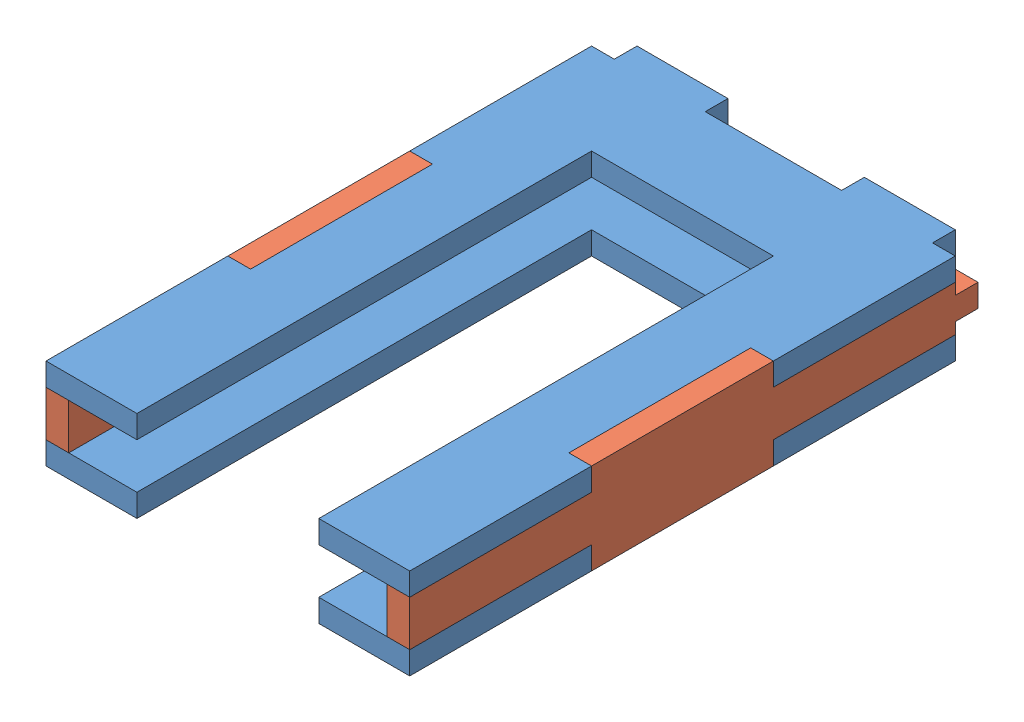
SolidWorks assembly Assem1.sldasm, configuration Default (file format 4700). Lengths in mm.
Overall size (50.8 12.7 79.38).
4 component instances, 2 part files, 9 mates.
Components (placement in the parent):
- fireguidefront-1: fireguidefront.SLDPRT [Default] at (0.7646 17.162 -13.1416) size (50.8 3.17 79.38)
- fireguideside-1: fireguideside.SLDPRT [Default] at (-21.4604 13.987 -13.1416) x (0 1 0) z (0 0 1) size (12.7 3.17 79.38)
- fireguidefront-2: fireguidefront.SLDPRT [Default] at (0.7646 7.637 -13.1416) size (50.8 3.17 79.38)
- fireguideside-2: fireguideside.SLDPRT [Default] at (22.9896 13.987 -13.1416) x (0 -1 0) z (0 0 1) size (12.7 3.17 79.38)
Mates (geometry in assembly coordinates):
- Coincident2: coincident aligned: plane of fireguidefront-1 through (-24.6354 20.337 40.8334) normal (0 1 0); plane of fireguideside-1 through (-24.6354 20.337 40.8334) normal (0 1 0)
- Coincident3: coincident anti-aligned: plane of fireguidefront-1 through (-21.4604 20.337 15.4334) normal (-1 0 0); plane of fireguideside-1 through (-21.4604 17.162 40.8334) normal (1 0 0)
- Coincident4: coincident anti-aligned: plane of fireguidefront-1 through (-24.6354 20.337 15.4334) normal (0 0 1); plane of fireguideside-1 through (-24.6354 20.337 15.4334) normal (0 0 -1)
- Coincident5: coincident aligned: plane of fireguidefront-1 through (-24.6354 20.337 40.8334) normal (0 1 0); plane of fireguideside-2 through (26.1646 20.337 40.8334) normal (0 1 0)
- Coincident6: coincident anti-aligned: plane of fireguidefront-1 through (22.9896 20.337 15.4334) normal (1 0 0); plane of fireguideside-2 through (22.9896 10.812 40.8334) normal (-1 0 0)
- Coincident7: coincident anti-aligned: plane of fireguidefront-1 through (26.1646 20.337 40.8334) normal (0 0 -1); plane of fireguideside-2 through (26.1646 20.337 40.8334) normal (0 0 1)
- Coincident8: coincident anti-aligned: plane of fireguideside-1 through (-21.4604 17.162 40.8334) normal (1 0 0); plane of fireguidefront-2 through (-21.4604 10.812 15.4334) normal (-1 0 0)
- Coincident9: coincident anti-aligned: plane of fireguideside-1 through (-24.6354 7.637 15.4334) normal (0 0 -1); plane of fireguidefront-2 through (-24.6354 10.812 15.4334) normal (0 0 1)
- Coincident10: coincident anti-aligned: plane of fireguideside-1 through (-24.6354 10.812 -9.9666) normal (0 -1 0); plane of fireguidefront-2 through (-24.6354 10.812 40.8334) normal (0 1 0)
